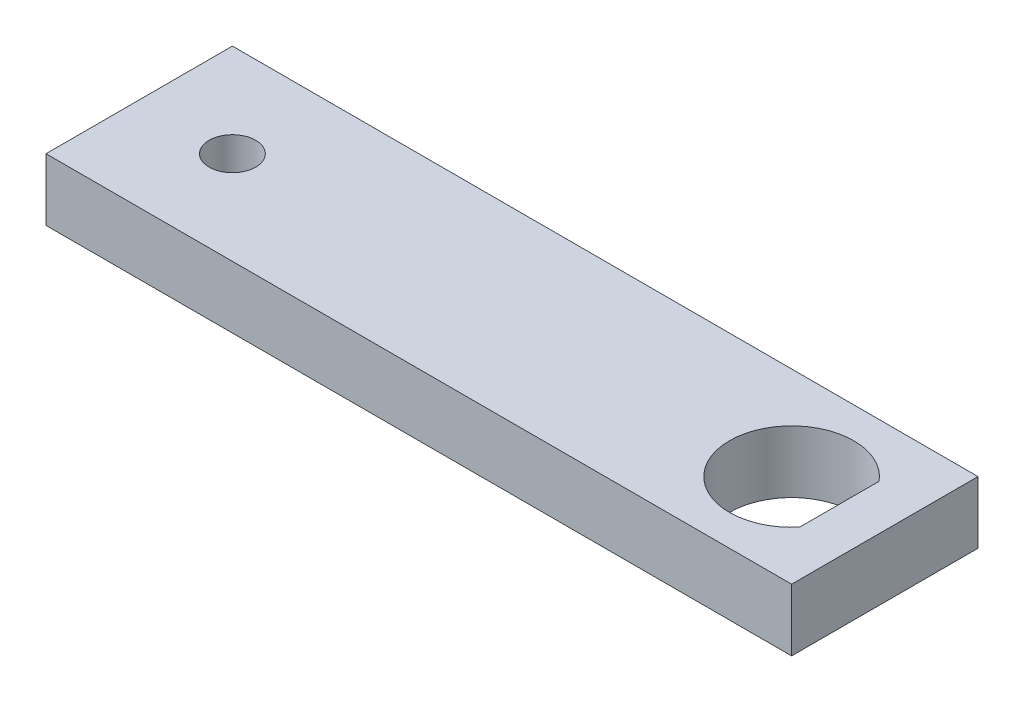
from build123d import *

# Parameters (mm, degrees)
SKETCH1_W          = 76.2
SKETCH1_H          = 6.35
BASE_EXTRUDE_DEPTH = 19.05
CUT_EXTRUDE1_DEPTH = 79.801427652
SKETCH3_R          = 2.38125
CUT_EXTRUDE2_DEPTH = 79.801427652


with BuildPart() as part:
    # Sketch1 → Base-Extrude (new body)
    with BuildSketch(Plane.XY):
        with Locations((38.1, 3.175)):
            Rectangle(SKETCH1_W, SKETCH1_H)
    extrude(amount=BASE_EXTRUDE_DEPTH)

    # Sketch2 → Cut-Extrude1 (cut, through all)
    with BuildSketch(Plane(origin=(0, 6.35, 0), x_dir=(-1, 0, 0), z_dir=(0, 1, 0))):
        with BuildLine():
            Line((-71.5645, 5.473421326), (-71.5645, 13.576578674))
            ThreePointArc((-71.5645, 13.576578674), (-60.325, 9.525), (-71.5645, 5.473421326))
        make_face()
    extrude(amount=-CUT_EXTRUDE1_DEPTH, mode=Mode.SUBTRACT)

    # Sketch3 → Cut-Extrude2 (cut, through all)
    with BuildSketch(Plane(origin=(0, 6.35, 0), x_dir=(-1, 0, 0), z_dir=(0, 1, 0))):
        with Locations((-9.525, 9.525)):
            Circle(SKETCH3_R)
    extrude(amount=-CUT_EXTRUDE2_DEPTH, mode=Mode.SUBTRACT)


solid = part.part
